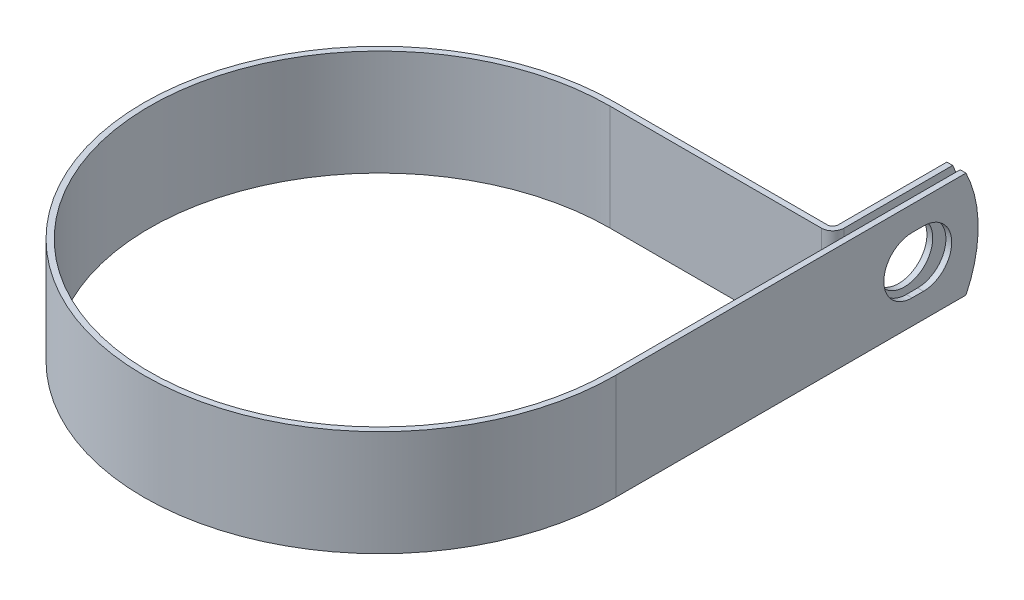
ISO-10303-21;
HEADER;
FILE_DESCRIPTION(('STEP AP214'),'2;1');
FILE_NAME('part.step','',(''),(''),'','','');
FILE_SCHEMA(('AUTOMOTIVE_DESIGN { 1 0 10303 214 1 1 1 1 }'));
ENDSEC;
DATA;
#1=APPLICATION_CONTEXT('core data for automotive mechanical design processes');
#2=APPLICATION_PROTOCOL_DEFINITION('international standard','automotive_design',2000,#1);
#3=PRODUCT_CONTEXT('',#1,'mechanical');
#4=PRODUCT('Part','Part','',(#3));
#5=PRODUCT_RELATED_PRODUCT_CATEGORY('part','',(#4));
#6=PRODUCT_DEFINITION_FORMATION('','',#4);
#7=PRODUCT_DEFINITION_CONTEXT('part definition',#1,'design');
#8=PRODUCT_DEFINITION('design','',#6,#7);
#9=PRODUCT_DEFINITION_SHAPE('','',#8);
#10=(LENGTH_UNIT() NAMED_UNIT(*) SI_UNIT(.MILLI.,.METRE.));
#11=(NAMED_UNIT(*) PLANE_ANGLE_UNIT() SI_UNIT($,.RADIAN.));
#12=(NAMED_UNIT(*) SI_UNIT($,.STERADIAN.) SOLID_ANGLE_UNIT());
#13=UNCERTAINTY_MEASURE_WITH_UNIT(LENGTH_MEASURE(1.E-05),#10,'distance_accuracy_value','');
#14=(GEOMETRIC_REPRESENTATION_CONTEXT(3) GLOBAL_UNCERTAINTY_ASSIGNED_CONTEXT((#13)) GLOBAL_UNIT_ASSIGNED_CONTEXT((#10,
#11,#12)) REPRESENTATION_CONTEXT('',''));
#15=CARTESIAN_POINT('',(0.,0.,0.));
#16=DIRECTION('',(0.,0.,1.));
#17=DIRECTION('',(1.,0.,0.));
#18=AXIS2_PLACEMENT_3D('',#15,#16,#17);
#19=CARTESIAN_POINT('',(48.4124,11.1125,0.));
#20=DIRECTION('',(-1.,0.,0.));
#21=DIRECTION('',(0.,0.,1.));
#22=AXIS2_PLACEMENT_3D('',#19,#20,#21);
#23=PLANE('',#22);
#24=DIRECTION('',(0.,0.,-1.));
#25=VECTOR('',#24,1.);
#26=CARTESIAN_POINT('',(48.4124,-5.9436,-62.3061999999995));
#27=LINE('',#26,#25);
#28=CARTESIAN_POINT('',(48.4124,-5.9436,-62.3061999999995));
#29=VERTEX_POINT('',#28);
#30=CARTESIAN_POINT('',(48.4124,-5.9436,-64.6938000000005));
#31=VERTEX_POINT('',#30);
#32=EDGE_CURVE('E236',#29,#31,#27,.T.);
#33=ORIENTED_EDGE('',*,*,#32,.T.);
#34=CARTESIAN_POINT('',(48.4124,0.,-64.6937999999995));
#35=DIRECTION('',(-1.,0.,0.));
#36=DIRECTION('',(0.,0.,1.));
#37=AXIS2_PLACEMENT_3D('',#34,#35,#36);
#38=CIRCLE('',#37,5.9436);
#39=CARTESIAN_POINT('',(48.4124,5.9436,-64.6938000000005));
#40=VERTEX_POINT('',#39);
#41=EDGE_CURVE('E257',#31,#40,#38,.F.);
#42=ORIENTED_EDGE('',*,*,#41,.T.);
#43=DIRECTION('',(0.,0.,1.));
#44=VECTOR('',#43,1.);
#45=CARTESIAN_POINT('',(48.4124,5.9436,-62.3061999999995));
#46=LINE('',#45,#44);
#47=CARTESIAN_POINT('',(48.4124,5.9436,-62.3061999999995));
#48=VERTEX_POINT('',#47);
#49=EDGE_CURVE('E253',#40,#48,#46,.T.);
#50=ORIENTED_EDGE('',*,*,#49,.T.);
#51=CARTESIAN_POINT('',(48.4124,0.,-62.3061999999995));
#52=DIRECTION('',(-1.,0.,0.));
#53=DIRECTION('',(0.,0.,1.));
#54=AXIS2_PLACEMENT_3D('',#51,#52,#53);
#55=CIRCLE('',#54,5.9436);
#56=EDGE_CURVE('E248',#48,#29,#55,.F.);
#57=ORIENTED_EDGE('',*,*,#56,.T.);
#58=EDGE_LOOP('',(#33,#42,#50,#57));
#59=FACE_BOUND('',#58,.T.);
#60=CARTESIAN_POINT('',(48.4124,0.,-50.8));
#61=DIRECTION('',(-1.,0.,0.));
#62=DIRECTION('',(0.,0.,1.));
#63=AXIS2_PLACEMENT_3D('',#60,#61,#62);
#64=CIRCLE('',#63,25.4);
#65=CARTESIAN_POINT('',(48.4124,11.1125,-73.6401476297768));
#66=VERTEX_POINT('',#65);
#67=CARTESIAN_POINT('',(48.4124,-11.1125,-73.6401476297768));
#68=VERTEX_POINT('',#67);
#69=EDGE_CURVE('E75',#66,#68,#64,.T.);
#70=ORIENTED_EDGE('',*,*,#69,.T.);
#71=DIRECTION('',(0.,0.,-1.));
#72=VECTOR('',#71,1.);
#73=CARTESIAN_POINT('',(48.4124,-11.1125,0.));
#74=LINE('',#73,#72);
#75=CARTESIAN_POINT('',(48.4124,-11.1125,0.));
#76=VERTEX_POINT('',#75);
#77=EDGE_CURVE('E271',#76,#68,#74,.T.);
#78=ORIENTED_EDGE('',*,*,#77,.F.);
#79=DIRECTION('',(0.,-1.,0.));
#80=VECTOR('',#79,1.);
#81=CARTESIAN_POINT('',(48.4124,11.1125,0.));
#82=LINE('',#81,#80);
#83=CARTESIAN_POINT('',(48.4124,11.1125,0.));
#84=VERTEX_POINT('',#83);
#85=EDGE_CURVE('E218',#84,#76,#82,.T.);
#86=ORIENTED_EDGE('',*,*,#85,.F.);
#87=DIRECTION('',(0.,0.,-1.));
#88=VECTOR('',#87,1.);
#89=CARTESIAN_POINT('',(48.4124,11.1125,-48.4124));
#90=LINE('',#89,#88);
#91=EDGE_CURVE('E273',#84,#66,#90,.T.);
#92=ORIENTED_EDGE('',*,*,#91,.T.);
#93=EDGE_LOOP('',(#70,#78,#86,#92));
#94=FACE_BOUND('',#93,.T.);
#95=ADVANCED_FACE('F54',(#59,#94),#23,.T.);
#96=CARTESIAN_POINT('',(46.8376,11.1125,-76.2));
#97=DIRECTION('',(1.,0.,0.));
#98=DIRECTION('',(0.,0.,-1.));
#99=AXIS2_PLACEMENT_3D('',#96,#97,#98);
#100=PLANE('',#99);
#101=CARTESIAN_POINT('',(46.8376,0.,-63.5));
#102=DIRECTION('',(1.,0.,0.));
#103=DIRECTION('',(0.,0.,-1.));
#104=AXIS2_PLACEMENT_3D('',#101,#102,#103);
#105=CIRCLE('',#104,5.9436);
#106=CARTESIAN_POINT('',(46.8376,0.,-69.4436));
#107=VERTEX_POINT('',#106);
#108=EDGE_CURVE('E268',#107,#107,#105,.F.);
#109=ORIENTED_EDGE('',*,*,#108,.T.);
#110=EDGE_LOOP('',(#109));
#111=FACE_BOUND('',#110,.T.);
#112=DIRECTION('',(0.,0.,1.));
#113=VECTOR('',#112,1.);
#114=CARTESIAN_POINT('',(46.8376,-11.1125,-76.2));
#115=LINE('',#114,#113);
#116=CARTESIAN_POINT('',(46.8376,-11.1125,-73.6401476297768));
#117=VERTEX_POINT('',#116);
#118=CARTESIAN_POINT('',(46.8376,-11.1125,-50.78984));
#119=VERTEX_POINT('',#118);
#120=EDGE_CURVE('E184',#117,#119,#115,.T.);
#121=ORIENTED_EDGE('',*,*,#120,.F.);
#122=CARTESIAN_POINT('',(46.8376,0.,-50.8));
#123=DIRECTION('',(1.,0.,0.));
#124=DIRECTION('',(0.,0.,-1.));
#125=AXIS2_PLACEMENT_3D('',#122,#123,#124);
#126=CIRCLE('',#125,25.4);
#127=CARTESIAN_POINT('',(46.8376,11.1125,-73.6401476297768));
#128=VERTEX_POINT('',#127);
#129=EDGE_CURVE('E176',#117,#128,#126,.T.);
#130=ORIENTED_EDGE('',*,*,#129,.T.);
#131=DIRECTION('',(0.,0.,1.));
#132=VECTOR('',#131,1.);
#133=CARTESIAN_POINT('',(46.8376,11.1125,-76.2));
#134=LINE('',#133,#132);
#135=CARTESIAN_POINT('',(46.8376,11.1125,-50.78984));
#136=VERTEX_POINT('',#135);
#137=EDGE_CURVE('E224',#128,#136,#134,.T.);
#138=ORIENTED_EDGE('',*,*,#137,.T.);
#139=DIRECTION('',(0.,-1.,0.));
#140=VECTOR('',#139,1.);
#141=CARTESIAN_POINT('',(46.8376,11.1125,-50.78984));
#142=LINE('',#141,#140);
#143=EDGE_CURVE('E211',#136,#119,#142,.T.);
#144=ORIENTED_EDGE('',*,*,#143,.T.);
#145=EDGE_LOOP('',(#121,#130,#138,#144));
#146=FACE_BOUND('',#145,.T.);
#147=ADVANCED_FACE('F226',(#111,#146),#100,.T.);
#148=CARTESIAN_POINT('',(45.6184,11.1125,-76.2));
#149=DIRECTION('',(1.,0.,0.));
#150=DIRECTION('',(0.,0.,-1.));
#151=AXIS2_PLACEMENT_3D('',#148,#149,#150);
#152=PLANE('',#151);
#153=CARTESIAN_POINT('',(45.6184,0.,-63.5));
#154=DIRECTION('',(-1.,0.,0.));
#155=DIRECTION('',(0.,0.,1.));
#156=AXIS2_PLACEMENT_3D('',#153,#154,#155);
#157=CIRCLE('',#156,5.9436);
#158=CARTESIAN_POINT('',(45.6184,0.,-57.5564));
#159=VERTEX_POINT('',#158);
#160=EDGE_CURVE('E265',#159,#159,#157,.T.);
#161=ORIENTED_EDGE('',*,*,#160,.F.);
#162=EDGE_LOOP('',(#161));
#163=FACE_BOUND('',#162,.T.);
#164=CARTESIAN_POINT('',(45.6184,0.,-50.8));
#165=DIRECTION('',(-1.,0.,0.));
#166=DIRECTION('',(0.,0.,1.));
#167=AXIS2_PLACEMENT_3D('',#164,#165,#166);
#168=CIRCLE('',#167,25.4);
#169=CARTESIAN_POINT('',(45.6184,11.1125,-73.6401476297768));
#170=VERTEX_POINT('',#169);
#171=CARTESIAN_POINT('',(45.6184,-11.1125,-73.6401476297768));
#172=VERTEX_POINT('',#171);
#173=EDGE_CURVE('E67',#170,#172,#168,.T.);
#174=ORIENTED_EDGE('',*,*,#173,.T.);
#175=DIRECTION('',(0.,0.,1.));
#176=VECTOR('',#175,1.);
#177=CARTESIAN_POINT('',(45.6184,-11.1125,-76.2));
#178=LINE('',#177,#176);
#179=CARTESIAN_POINT('',(45.6184,-11.1125,-50.78984));
#180=VERTEX_POINT('',#179);
#181=EDGE_CURVE('E167',#172,#180,#178,.T.);
#182=ORIENTED_EDGE('',*,*,#181,.T.);
#183=DIRECTION('',(0.,-1.,0.));
#184=VECTOR('',#183,1.);
#185=CARTESIAN_POINT('',(45.6184,11.1125,-50.78984));
#186=LINE('',#185,#184);
#187=CARTESIAN_POINT('',(45.6184,11.1125,-50.78984));
#188=VERTEX_POINT('',#187);
#189=EDGE_CURVE('E209',#188,#180,#186,.T.);
#190=ORIENTED_EDGE('',*,*,#189,.F.);
#191=DIRECTION('',(0.,0.,1.));
#192=VECTOR('',#191,1.);
#193=CARTESIAN_POINT('',(45.6184,11.1125,-76.2));
#194=LINE('',#193,#192);
#195=EDGE_CURVE('E169',#170,#188,#194,.T.);
#196=ORIENTED_EDGE('',*,*,#195,.F.);
#197=EDGE_LOOP('',(#174,#182,#190,#196));
#198=FACE_BOUND('',#197,.T.);
#199=ADVANCED_FACE('F164',(#163,#198),#152,.F.);
#200=CARTESIAN_POINT('',(49.6316,11.1125,0.));
#201=DIRECTION('',(-1.,0.,0.));
#202=DIRECTION('',(0.,0.,1.));
#203=AXIS2_PLACEMENT_3D('',#200,#201,#202);
#204=PLANE('',#203);
#205=CARTESIAN_POINT('',(49.6316,0.,-64.6937999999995));
#206=DIRECTION('',(1.,0.,0.));
#207=DIRECTION('',(0.,0.,-1.));
#208=AXIS2_PLACEMENT_3D('',#205,#206,#207);
#209=CIRCLE('',#208,5.9436);
#210=CARTESIAN_POINT('',(49.6316,-5.9436,-64.6938000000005));
#211=VERTEX_POINT('',#210);
#212=CARTESIAN_POINT('',(49.6316,5.9436,-64.6938000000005));
#213=VERTEX_POINT('',#212);
#214=EDGE_CURVE('E237',#211,#213,#209,.T.);
#215=ORIENTED_EDGE('',*,*,#214,.F.);
#216=DIRECTION('',(0.,0.,-1.));
#217=VECTOR('',#216,1.);
#218=CARTESIAN_POINT('',(49.6316,-5.9436,-62.3061999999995));
#219=LINE('',#218,#217);
#220=CARTESIAN_POINT('',(49.6316,-5.9436,-62.3061999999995));
#221=VERTEX_POINT('',#220);
#222=EDGE_CURVE('E240',#221,#211,#219,.T.);
#223=ORIENTED_EDGE('',*,*,#222,.F.);
#224=CARTESIAN_POINT('',(49.6316,0.,-62.3061999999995));
#225=DIRECTION('',(1.,0.,0.));
#226=DIRECTION('',(0.,0.,-1.));
#227=AXIS2_PLACEMENT_3D('',#224,#225,#226);
#228=CIRCLE('',#227,5.9436);
#229=CARTESIAN_POINT('',(49.6316,5.9436,-62.3061999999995));
#230=VERTEX_POINT('',#229);
#231=EDGE_CURVE('E230',#230,#221,#228,.T.);
#232=ORIENTED_EDGE('',*,*,#231,.F.);
#233=DIRECTION('',(0.,0.,1.));
#234=VECTOR('',#233,1.);
#235=CARTESIAN_POINT('',(49.6316,5.9436,-62.3061999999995));
#236=LINE('',#235,#234);
#237=EDGE_CURVE('E234',#213,#230,#236,.T.);
#238=ORIENTED_EDGE('',*,*,#237,.F.);
#239=EDGE_LOOP('',(#215,#223,#232,#238));
#240=FACE_BOUND('',#239,.T.);
#241=DIRECTION('',(0.,0.,-1.));
#242=VECTOR('',#241,1.);
#243=CARTESIAN_POINT('',(49.6316,-11.1125,0.));
#244=LINE('',#243,#242);
#245=CARTESIAN_POINT('',(49.6316,-11.1125,0.));
#246=VERTEX_POINT('',#245);
#247=CARTESIAN_POINT('',(49.6316,-11.1125,-73.6401476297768));
#248=VERTEX_POINT('',#247);
#249=EDGE_CURVE('E195',#246,#248,#244,.T.);
#250=ORIENTED_EDGE('',*,*,#249,.T.);
#251=CARTESIAN_POINT('',(49.6316,0.,-50.8));
#252=DIRECTION('',(-1.,0.,0.));
#253=DIRECTION('',(0.,0.,1.));
#254=AXIS2_PLACEMENT_3D('',#251,#252,#253);
#255=CIRCLE('',#254,25.4);
#256=CARTESIAN_POINT('',(49.6316,11.1125,-73.6401476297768));
#257=VERTEX_POINT('',#256);
#258=EDGE_CURVE('E170',#257,#248,#255,.T.);
#259=ORIENTED_EDGE('',*,*,#258,.F.);
#260=DIRECTION('',(0.,0.,-1.));
#261=VECTOR('',#260,1.);
#262=CARTESIAN_POINT('',(49.6316,11.1125,-48.4124));
#263=LINE('',#262,#261);
#264=CARTESIAN_POINT('',(49.6316,11.1125,0.));
#265=VERTEX_POINT('',#264);
#266=EDGE_CURVE('E198',#265,#257,#263,.T.);
#267=ORIENTED_EDGE('',*,*,#266,.F.);
#268=DIRECTION('',(0.,-1.,0.));
#269=VECTOR('',#268,1.);
#270=CARTESIAN_POINT('',(49.6316,11.1125,0.));
#271=LINE('',#270,#269);
#272=EDGE_CURVE('E199',#265,#246,#271,.T.);
#273=ORIENTED_EDGE('',*,*,#272,.T.);
#274=EDGE_LOOP('',(#250,#259,#267,#273));
#275=FACE_BOUND('',#274,.T.);
#276=ADVANCED_FACE('F321',(#240,#275),#204,.F.);
#277=CARTESIAN_POINT('',(0.,-11.1125,0.));
#278=DIRECTION('',(0.,1.,0.));
#279=DIRECTION('',(1.,0.,0.));
#280=AXIS2_PLACEMENT_3D('',#277,#278,#279);
#281=PLANE('',#280);
#282=DIRECTION('',(-1.,0.,0.));
#283=VECTOR('',#282,1.);
#284=CARTESIAN_POINT('',(49.6316,-11.1125,-73.6401476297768));
#285=LINE('',#284,#283);
#286=EDGE_CURVE('E171',#248,#68,#285,.T.);
#287=ORIENTED_EDGE('',*,*,#286,.F.);
#288=ORIENTED_EDGE('',*,*,#249,.F.);
#289=CARTESIAN_POINT('',(0.,-11.1125,0.));
#290=DIRECTION('',(0.,1.,0.));
#291=DIRECTION('',(1.,0.,0.));
#292=AXIS2_PLACEMENT_3D('',#289,#290,#291);
#293=CIRCLE('',#292,49.6316);
#294=CARTESIAN_POINT('',(0.,-11.1125,-49.6316));
#295=VERTEX_POINT('',#294);
#296=EDGE_CURVE('E193',#295,#246,#293,.T.);
#297=ORIENTED_EDGE('',*,*,#296,.F.);
#298=DIRECTION('',(1.,0.,0.));
#299=VECTOR('',#298,1.);
#300=CARTESIAN_POINT('',(0.,-11.1125,-49.6316));
#301=LINE('',#300,#299);
#302=CARTESIAN_POINT('',(44.46016,-11.1125,-49.6316));
#303=VERTEX_POINT('',#302);
#304=EDGE_CURVE('E186',#303,#295,#301,.F.);
#305=ORIENTED_EDGE('',*,*,#304,.F.);
#306=CARTESIAN_POINT('',(44.46016,-11.1125,-50.78984));
#307=DIRECTION('',(0.,1.,0.));
#308=DIRECTION('',(1.,0.,0.));
#309=AXIS2_PLACEMENT_3D('',#306,#307,#308);
#310=CIRCLE('',#309,1.15824);
#311=EDGE_CURVE('E183',#180,#303,#310,.F.);
#312=ORIENTED_EDGE('',*,*,#311,.F.);
#313=ORIENTED_EDGE('',*,*,#181,.F.);
#314=DIRECTION('',(-1.,0.,0.));
#315=VECTOR('',#314,1.);
#316=CARTESIAN_POINT('',(49.6316,-11.1125,-73.6401476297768));
#317=LINE('',#316,#315);
#318=EDGE_CURVE('E12',#117,#172,#317,.T.);
#319=ORIENTED_EDGE('',*,*,#318,.F.);
#320=ORIENTED_EDGE('',*,*,#120,.T.);
#321=CARTESIAN_POINT('',(44.46016,-11.1125,-50.78984));
#322=DIRECTION('',(0.,-1.,0.));
#323=DIRECTION('',(0.,0.,1.));
#324=AXIS2_PLACEMENT_3D('',#321,#322,#323);
#325=CIRCLE('',#324,2.37744);
#326=CARTESIAN_POINT('',(44.46016,-11.1125,-48.4124));
#327=VERTEX_POINT('',#326);
#328=EDGE_CURVE('E188',#119,#327,#325,.T.);
#329=ORIENTED_EDGE('',*,*,#328,.T.);
#330=DIRECTION('',(-1.,0.,0.));
#331=VECTOR('',#330,1.);
#332=CARTESIAN_POINT('',(0.,-11.1125,-48.4124));
#333=LINE('',#332,#331);
#334=CARTESIAN_POINT('',(0.,-11.1125,-48.4124));
#335=VERTEX_POINT('',#334);
#336=EDGE_CURVE('E298',#327,#335,#333,.T.);
#337=ORIENTED_EDGE('',*,*,#336,.T.);
#338=CARTESIAN_POINT('',(0.,-11.1125,0.));
#339=DIRECTION('',(0.,1.,0.));
#340=DIRECTION('',(0.,0.,1.));
#341=AXIS2_PLACEMENT_3D('',#338,#339,#340);
#342=CIRCLE('',#341,48.4124);
#343=EDGE_CURVE('E295',#335,#76,#342,.T.);
#344=ORIENTED_EDGE('',*,*,#343,.T.);
#345=ORIENTED_EDGE('',*,*,#77,.T.);
#346=EDGE_LOOP('',(#287,#288,#297,#305,#312,#313,#319,#320,#329,#337,#344,#345));
#347=FACE_BOUND('',#346,.T.);
#348=ADVANCED_FACE('F181',(#347),#281,.F.);
#349=CARTESIAN_POINT('',(0.,11.1125,0.));
#350=DIRECTION('',(0.,1.,0.));
#351=DIRECTION('',(1.,0.,0.));
#352=AXIS2_PLACEMENT_3D('',#349,#350,#351);
#353=PLANE('',#352);
#354=ORIENTED_EDGE('',*,*,#266,.T.);
#355=DIRECTION('',(-1.,0.,0.));
#356=VECTOR('',#355,1.);
#357=CARTESIAN_POINT('',(49.6316,11.1125,-73.6401476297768));
#358=LINE('',#357,#356);
#359=EDGE_CURVE('E228',#257,#66,#358,.T.);
#360=ORIENTED_EDGE('',*,*,#359,.T.);
#361=ORIENTED_EDGE('',*,*,#91,.F.);
#362=CARTESIAN_POINT('',(0.,11.1125,0.));
#363=DIRECTION('',(0.,1.,0.));
#364=DIRECTION('',(0.,0.,1.));
#365=AXIS2_PLACEMENT_3D('',#362,#363,#364);
#366=CIRCLE('',#365,48.4124);
#367=CARTESIAN_POINT('',(0.,11.1125,-48.4124));
#368=VERTEX_POINT('',#367);
#369=EDGE_CURVE('E276',#368,#84,#366,.T.);
#370=ORIENTED_EDGE('',*,*,#369,.F.);
#371=DIRECTION('',(-1.,0.,0.));
#372=VECTOR('',#371,1.);
#373=CARTESIAN_POINT('',(0.,11.1125,-48.4124));
#374=LINE('',#373,#372);
#375=CARTESIAN_POINT('',(44.46016,11.1125,-48.4124));
#376=VERTEX_POINT('',#375);
#377=EDGE_CURVE('E279',#376,#368,#374,.T.);
#378=ORIENTED_EDGE('',*,*,#377,.F.);
#379=CARTESIAN_POINT('',(44.46016,11.1125,-50.78984));
#380=DIRECTION('',(0.,-1.,0.));
#381=DIRECTION('',(0.,0.,1.));
#382=AXIS2_PLACEMENT_3D('',#379,#380,#381);
#383=CIRCLE('',#382,2.37744);
#384=EDGE_CURVE('E282',#136,#376,#383,.T.);
#385=ORIENTED_EDGE('',*,*,#384,.F.);
#386=ORIENTED_EDGE('',*,*,#137,.F.);
#387=DIRECTION('',(-1.,0.,0.));
#388=VECTOR('',#387,1.);
#389=CARTESIAN_POINT('',(49.6316,11.1125,-73.6401476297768));
#390=LINE('',#389,#388);
#391=EDGE_CURVE('E61',#128,#170,#390,.T.);
#392=ORIENTED_EDGE('',*,*,#391,.T.);
#393=ORIENTED_EDGE('',*,*,#195,.T.);
#394=CARTESIAN_POINT('',(44.46016,11.1125,-50.78984));
#395=DIRECTION('',(0.,1.,0.));
#396=DIRECTION('',(1.,0.,0.));
#397=AXIS2_PLACEMENT_3D('',#394,#395,#396);
#398=CIRCLE('',#397,1.15824);
#399=CARTESIAN_POINT('',(44.46016,11.1125,-49.6316));
#400=VERTEX_POINT('',#399);
#401=EDGE_CURVE('E287',#188,#400,#398,.F.);
#402=ORIENTED_EDGE('',*,*,#401,.T.);
#403=DIRECTION('',(1.,0.,0.));
#404=VECTOR('',#403,1.);
#405=CARTESIAN_POINT('',(0.,11.1125,-49.6316));
#406=LINE('',#405,#404);
#407=CARTESIAN_POINT('',(0.,11.1125,-49.6316));
#408=VERTEX_POINT('',#407);
#409=EDGE_CURVE('E289',#400,#408,#406,.F.);
#410=ORIENTED_EDGE('',*,*,#409,.T.);
#411=CARTESIAN_POINT('',(0.,11.1125,0.));
#412=DIRECTION('',(0.,1.,0.));
#413=DIRECTION('',(1.,0.,0.));
#414=AXIS2_PLACEMENT_3D('',#411,#412,#413);
#415=CIRCLE('',#414,49.6316);
#416=EDGE_CURVE('E203',#408,#265,#415,.T.);
#417=ORIENTED_EDGE('',*,*,#416,.T.);
#418=EDGE_LOOP('',(#354,#360,#361,#370,#378,#385,#386,#392,#393,#402,#410,#417));
#419=FACE_BOUND('',#418,.T.);
#420=ADVANCED_FACE('F222',(#419),#353,.T.);
#421=CARTESIAN_POINT('',(0.,11.1125,0.));
#422=DIRECTION('',(0.,-1.,0.));
#423=DIRECTION('',(0.,0.,-1.));
#424=AXIS2_PLACEMENT_3D('',#421,#422,#423);
#425=CYLINDRICAL_SURFACE('',#424,48.4124);
#426=ORIENTED_EDGE('',*,*,#343,.F.);
#427=DIRECTION('',(0.,-1.,0.));
#428=VECTOR('',#427,1.);
#429=CARTESIAN_POINT('',(0.,11.1125,-48.4124));
#430=LINE('',#429,#428);
#431=EDGE_CURVE('E216',#368,#335,#430,.T.);
#432=ORIENTED_EDGE('',*,*,#431,.F.);
#433=ORIENTED_EDGE('',*,*,#369,.T.);
#434=ORIENTED_EDGE('',*,*,#85,.T.);
#435=EDGE_LOOP('',(#426,#432,#433,#434));
#436=FACE_BOUND('',#435,.T.);
#437=ADVANCED_FACE('F311',(#436),#425,.F.);
#438=CARTESIAN_POINT('',(0.,11.1125,-48.4124));
#439=DIRECTION('',(0.,0.,1.));
#440=DIRECTION('',(1.,0.,0.));
#441=AXIS2_PLACEMENT_3D('',#438,#439,#440);
#442=PLANE('',#441);
#443=ORIENTED_EDGE('',*,*,#336,.F.);
#444=DIRECTION('',(0.,-1.,0.));
#445=VECTOR('',#444,1.);
#446=CARTESIAN_POINT('',(44.46016,11.1125,-48.4124));
#447=LINE('',#446,#445);
#448=EDGE_CURVE('E214',#376,#327,#447,.T.);
#449=ORIENTED_EDGE('',*,*,#448,.F.);
#450=ORIENTED_EDGE('',*,*,#377,.T.);
#451=ORIENTED_EDGE('',*,*,#431,.T.);
#452=EDGE_LOOP('',(#443,#449,#450,#451));
#453=FACE_BOUND('',#452,.T.);
#454=ADVANCED_FACE('F307',(#453),#442,.T.);
#455=CARTESIAN_POINT('',(44.46016,11.1125,-50.78984));
#456=DIRECTION('',(0.,-1.,0.));
#457=DIRECTION('',(0.,0.,-1.));
#458=AXIS2_PLACEMENT_3D('',#455,#456,#457);
#459=CYLINDRICAL_SURFACE('',#458,2.37744);
#460=ORIENTED_EDGE('',*,*,#328,.F.);
#461=ORIENTED_EDGE('',*,*,#143,.F.);
#462=ORIENTED_EDGE('',*,*,#384,.T.);
#463=ORIENTED_EDGE('',*,*,#448,.T.);
#464=EDGE_LOOP('',(#460,#461,#462,#463));
#465=FACE_BOUND('',#464,.T.);
#466=ADVANCED_FACE('F304',(#465),#459,.T.);
#467=CARTESIAN_POINT('',(44.46016,11.1125,-50.78984));
#468=DIRECTION('',(0.,-1.,0.));
#469=DIRECTION('',(0.,0.,-1.));
#470=AXIS2_PLACEMENT_3D('',#467,#468,#469);
#471=CYLINDRICAL_SURFACE('',#470,1.15824);
#472=ORIENTED_EDGE('',*,*,#311,.T.);
#473=DIRECTION('',(0.,-1.,0.));
#474=VECTOR('',#473,1.);
#475=CARTESIAN_POINT('',(44.46016,11.1125,-49.6316));
#476=LINE('',#475,#474);
#477=EDGE_CURVE('E206',#400,#303,#476,.T.);
#478=ORIENTED_EDGE('',*,*,#477,.F.);
#479=ORIENTED_EDGE('',*,*,#401,.F.);
#480=ORIENTED_EDGE('',*,*,#189,.T.);
#481=EDGE_LOOP('',(#472,#478,#479,#480));
#482=FACE_BOUND('',#481,.T.);
#483=ADVANCED_FACE('F334',(#482),#471,.F.);
#484=CARTESIAN_POINT('',(0.,11.1125,-49.6316));
#485=DIRECTION('',(0.,0.,1.));
#486=DIRECTION('',(1.,0.,0.));
#487=AXIS2_PLACEMENT_3D('',#484,#485,#486);
#488=PLANE('',#487);
#489=ORIENTED_EDGE('',*,*,#304,.T.);
#490=DIRECTION('',(0.,-1.,0.));
#491=VECTOR('',#490,1.);
#492=CARTESIAN_POINT('',(0.,11.1125,-49.6316));
#493=LINE('',#492,#491);
#494=EDGE_CURVE('E202',#408,#295,#493,.T.);
#495=ORIENTED_EDGE('',*,*,#494,.F.);
#496=ORIENTED_EDGE('',*,*,#409,.F.);
#497=ORIENTED_EDGE('',*,*,#477,.T.);
#498=EDGE_LOOP('',(#489,#495,#496,#497));
#499=FACE_BOUND('',#498,.T.);
#500=ADVANCED_FACE('F330',(#499),#488,.F.);
#501=CARTESIAN_POINT('',(0.,11.1125,0.));
#502=DIRECTION('',(0.,-1.,0.));
#503=DIRECTION('',(0.,0.,-1.));
#504=AXIS2_PLACEMENT_3D('',#501,#502,#503);
#505=CYLINDRICAL_SURFACE('',#504,49.6316);
#506=ORIENTED_EDGE('',*,*,#296,.T.);
#507=ORIENTED_EDGE('',*,*,#272,.F.);
#508=ORIENTED_EDGE('',*,*,#416,.F.);
#509=ORIENTED_EDGE('',*,*,#494,.T.);
#510=EDGE_LOOP('',(#506,#507,#508,#509));
#511=FACE_BOUND('',#510,.T.);
#512=ADVANCED_FACE('F327',(#511),#505,.T.);
#513=CARTESIAN_POINT('',(63.6486394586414,0.,-63.5));
#514=DIRECTION('',(-1.,0.,0.));
#515=DIRECTION('',(0.,0.,1.));
#516=AXIS2_PLACEMENT_3D('',#513,#514,#515);
#517=CYLINDRICAL_SURFACE('',#516,5.9436);
#518=ORIENTED_EDGE('',*,*,#160,.T.);
#519=EDGE_LOOP('',(#518));
#520=FACE_BOUND('',#519,.T.);
#521=ORIENTED_EDGE('',*,*,#108,.F.);
#522=EDGE_LOOP('',(#521));
#523=FACE_BOUND('',#522,.T.);
#524=ADVANCED_FACE('F379',(#520,#523),#517,.F.);
#525=CARTESIAN_POINT('',(29.8361937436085,-5.9436,-62.3061999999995));
#526=DIRECTION('',(0.,-1.,0.));
#527=DIRECTION('',(0.,0.,-1.));
#528=AXIS2_PLACEMENT_3D('',#525,#526,#527);
#529=PLANE('',#528);
#530=DIRECTION('',(1.,0.,0.));
#531=VECTOR('',#530,1.);
#532=CARTESIAN_POINT('',(29.8361937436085,-5.9436,-62.3061999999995));
#533=LINE('',#532,#531);
#534=EDGE_CURVE('E251',#29,#221,#533,.T.);
#535=ORIENTED_EDGE('',*,*,#534,.T.);
#536=ORIENTED_EDGE('',*,*,#222,.T.);
#537=DIRECTION('',(1.,0.,0.));
#538=VECTOR('',#537,1.);
#539=CARTESIAN_POINT('',(29.8361937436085,-5.9436,-64.6938000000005));
#540=LINE('',#539,#538);
#541=EDGE_CURVE('E247',#31,#211,#540,.T.);
#542=ORIENTED_EDGE('',*,*,#541,.F.);
#543=ORIENTED_EDGE('',*,*,#32,.F.);
#544=EDGE_LOOP('',(#535,#536,#542,#543));
#545=FACE_BOUND('',#544,.T.);
#546=ADVANCED_FACE('F354',(#545),#529,.F.);
#547=CARTESIAN_POINT('',(29.8361937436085,0.,-64.6937999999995));
#548=DIRECTION('',(1.,0.,0.));
#549=DIRECTION('',(0.,0.,-1.));
#550=AXIS2_PLACEMENT_3D('',#547,#548,#549);
#551=CYLINDRICAL_SURFACE('',#550,5.9436);
#552=ORIENTED_EDGE('',*,*,#541,.T.);
#553=ORIENTED_EDGE('',*,*,#214,.T.);
#554=DIRECTION('',(1.,0.,0.));
#555=VECTOR('',#554,1.);
#556=CARTESIAN_POINT('',(29.8361937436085,5.9436,-64.6938000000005));
#557=LINE('',#556,#555);
#558=EDGE_CURVE('E256',#40,#213,#557,.T.);
#559=ORIENTED_EDGE('',*,*,#558,.F.);
#560=ORIENTED_EDGE('',*,*,#41,.F.);
#561=EDGE_LOOP('',(#552,#553,#559,#560));
#562=FACE_BOUND('',#561,.T.);
#563=ADVANCED_FACE('F358',(#562),#551,.F.);
#564=CARTESIAN_POINT('',(29.8361937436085,5.9436,-62.3061999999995));
#565=DIRECTION('',(0.,1.,0.));
#566=DIRECTION('',(0.,0.,1.));
#567=AXIS2_PLACEMENT_3D('',#564,#565,#566);
#568=PLANE('',#567);
#569=ORIENTED_EDGE('',*,*,#558,.T.);
#570=ORIENTED_EDGE('',*,*,#237,.T.);
#571=DIRECTION('',(1.,0.,0.));
#572=VECTOR('',#571,1.);
#573=CARTESIAN_POINT('',(29.8361937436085,5.9436,-62.3061999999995));
#574=LINE('',#573,#572);
#575=EDGE_CURVE('E252',#48,#230,#574,.T.);
#576=ORIENTED_EDGE('',*,*,#575,.F.);
#577=ORIENTED_EDGE('',*,*,#49,.F.);
#578=EDGE_LOOP('',(#569,#570,#576,#577));
#579=FACE_BOUND('',#578,.T.);
#580=ADVANCED_FACE('F362',(#579),#568,.F.);
#581=CARTESIAN_POINT('',(29.8361937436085,0.,-62.3061999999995));
#582=DIRECTION('',(1.,0.,0.));
#583=DIRECTION('',(0.,0.,-1.));
#584=AXIS2_PLACEMENT_3D('',#581,#582,#583);
#585=CYLINDRICAL_SURFACE('',#584,5.9436);
#586=ORIENTED_EDGE('',*,*,#575,.T.);
#587=ORIENTED_EDGE('',*,*,#231,.T.);
#588=ORIENTED_EDGE('',*,*,#534,.F.);
#589=ORIENTED_EDGE('',*,*,#56,.F.);
#590=EDGE_LOOP('',(#586,#587,#588,#589));
#591=FACE_BOUND('',#590,.T.);
#592=ADVANCED_FACE('F366',(#591),#585,.F.);
#593=CARTESIAN_POINT('',(49.6316,0.,-50.8));
#594=DIRECTION('',(-1.,0.,0.));
#595=DIRECTION('',(0.,0.,1.));
#596=AXIS2_PLACEMENT_3D('',#593,#594,#595);
#597=CYLINDRICAL_SURFACE('',#596,25.4);
#598=ORIENTED_EDGE('',*,*,#129,.F.);
#599=ORIENTED_EDGE('',*,*,#318,.T.);
#600=ORIENTED_EDGE('',*,*,#173,.F.);
#601=ORIENTED_EDGE('',*,*,#391,.F.);
#602=EDGE_LOOP('',(#598,#599,#600,#601));
#603=FACE_BOUND('',#602,.T.);
#604=ADVANCED_FACE('F174',(#603),#597,.T.);
#605=ORIENTED_EDGE('',*,*,#359,.F.);
#606=ORIENTED_EDGE('',*,*,#258,.T.);
#607=ORIENTED_EDGE('',*,*,#286,.T.);
#608=ORIENTED_EDGE('',*,*,#69,.F.);
#609=EDGE_LOOP('',(#605,#606,#607,#608));
#610=FACE_BOUND('',#609,.T.);
#611=ADVANCED_FACE('F316',(#610),#597,.T.);
#612=CLOSED_SHELL('',(#95,#147,#199,#276,#348,#420,#437,#454,#466,#483,#500,#512,#524,#546,#563,
#580,#592,#604,#611));
#613=MANIFOLD_SOLID_BREP('B2',#612);
#614=ADVANCED_BREP_SHAPE_REPRESENTATION('',(#18,#613),#14);
#615=SHAPE_DEFINITION_REPRESENTATION(#9,#614);
ENDSEC;
END-ISO-10303-21;
